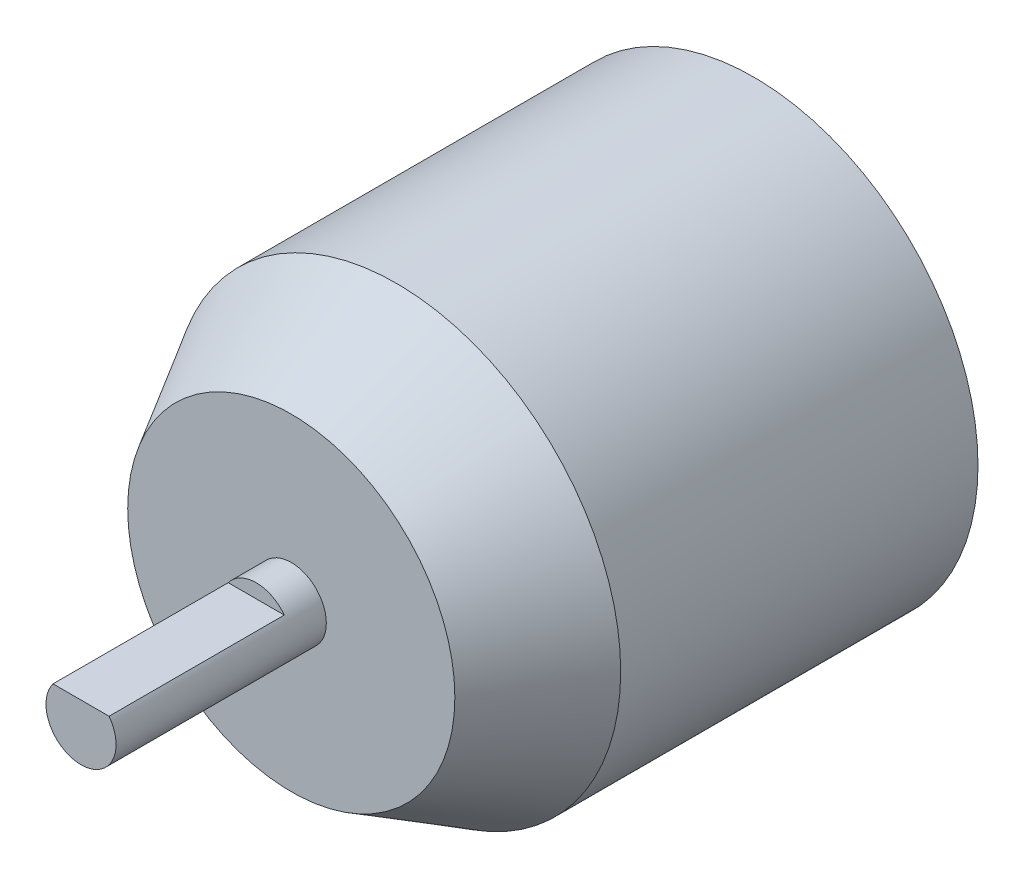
ISO-10303-21;
HEADER;
FILE_DESCRIPTION(('STEP AP214'),'2;1');
FILE_NAME('part.step','',(''),(''),'','','');
FILE_SCHEMA(('AUTOMOTIVE_DESIGN { 1 0 10303 214 1 1 1 1 }'));
ENDSEC;
DATA;
#1=APPLICATION_CONTEXT('core data for automotive mechanical design processes');
#2=APPLICATION_PROTOCOL_DEFINITION('international standard','automotive_design',2000,#1);
#3=PRODUCT_CONTEXT('',#1,'mechanical');
#4=PRODUCT('Part','Part','',(#3));
#5=PRODUCT_RELATED_PRODUCT_CATEGORY('part','',(#4));
#6=PRODUCT_DEFINITION_FORMATION('','',#4);
#7=PRODUCT_DEFINITION_CONTEXT('part definition',#1,'design');
#8=PRODUCT_DEFINITION('design','',#6,#7);
#9=PRODUCT_DEFINITION_SHAPE('','',#8);
#10=(LENGTH_UNIT() NAMED_UNIT(*) SI_UNIT(.MILLI.,.METRE.));
#11=(NAMED_UNIT(*) PLANE_ANGLE_UNIT() SI_UNIT($,.RADIAN.));
#12=(NAMED_UNIT(*) SI_UNIT($,.STERADIAN.) SOLID_ANGLE_UNIT());
#13=UNCERTAINTY_MEASURE_WITH_UNIT(LENGTH_MEASURE(1.E-05),#10,'distance_accuracy_value','');
#14=(GEOMETRIC_REPRESENTATION_CONTEXT(3) GLOBAL_UNCERTAINTY_ASSIGNED_CONTEXT((#13)) GLOBAL_UNIT_ASSIGNED_CONTEXT((#10,
#11,#12)) REPRESENTATION_CONTEXT('',''));
#15=CARTESIAN_POINT('',(0.,0.,0.));
#16=DIRECTION('',(0.,0.,1.));
#17=DIRECTION('',(1.,0.,0.));
#18=AXIS2_PLACEMENT_3D('',#15,#16,#17);
#19=CARTESIAN_POINT('',(0.,0.,70.));
#20=DIRECTION('',(0.,0.,-1.));
#21=DIRECTION('',(-1.,0.,0.));
#22=AXIS2_PLACEMENT_3D('',#19,#20,#21);
#23=CYLINDRICAL_SURFACE('',#22,32.);
#24=CARTESIAN_POINT('',(0.,0.,4.01923788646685));
#25=DIRECTION('',(0.,0.,1.));
#26=DIRECTION('',(1.,0.,0.));
#27=AXIS2_PLACEMENT_3D('',#24,#25,#26);
#28=CIRCLE('',#27,32.);
#29=CARTESIAN_POINT('',(32.,0.,4.01923788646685));
#30=VERTEX_POINT('',#29);
#31=EDGE_CURVE('E84',#30,#30,#28,.T.);
#32=ORIENTED_EDGE('',*,*,#31,.T.);
#33=EDGE_LOOP('',(#32));
#34=FACE_BOUND('',#33,.T.);
#35=CARTESIAN_POINT('',(0.,0.,54.9999999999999));
#36=DIRECTION('',(0.,0.,1.));
#37=DIRECTION('',(1.,0.,0.));
#38=AXIS2_PLACEMENT_3D('',#35,#36,#37);
#39=CIRCLE('',#38,32.);
#40=CARTESIAN_POINT('',(32.,0.,54.9999999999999));
#41=VERTEX_POINT('',#40);
#42=EDGE_CURVE('E81',#41,#41,#39,.F.);
#43=ORIENTED_EDGE('',*,*,#42,.T.);
#44=EDGE_LOOP('',(#43));
#45=FACE_BOUND('',#44,.T.);
#46=ADVANCED_FACE('F34',(#34,#45),#23,.T.);
#47=CARTESIAN_POINT('',(0.,0.,70.));
#48=DIRECTION('',(0.,0.,1.));
#49=DIRECTION('',(1.,0.,0.));
#50=AXIS2_PLACEMENT_3D('',#47,#48,#49);
#51=PLANE('',#50);
#52=CARTESIAN_POINT('',(0.,0.,70.));
#53=DIRECTION('',(0.,0.,1.));
#54=DIRECTION('',(1.,0.,0.));
#55=AXIS2_PLACEMENT_3D('',#52,#53,#54);
#56=CIRCLE('',#55,23.3397459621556);
#57=CARTESIAN_POINT('',(23.3397459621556,0.,70.));
#58=VERTEX_POINT('',#57);
#59=EDGE_CURVE('E75',#58,#58,#56,.T.);
#60=ORIENTED_EDGE('',*,*,#59,.T.);
#61=EDGE_LOOP('',(#60));
#62=FACE_BOUND('',#61,.T.);
#63=CARTESIAN_POINT('',(0.,0.,70.));
#64=DIRECTION('',(0.,0.,1.));
#65=DIRECTION('',(1.,0.,0.));
#66=AXIS2_PLACEMENT_3D('',#63,#64,#65);
#67=CIRCLE('',#66,5.);
#68=CARTESIAN_POINT('',(5.,0.,70.));
#69=VERTEX_POINT('',#68);
#70=EDGE_CURVE('E72',#69,#69,#67,.T.);
#71=ORIENTED_EDGE('',*,*,#70,.F.);
#72=EDGE_LOOP('',(#71));
#73=FACE_BOUND('',#72,.T.);
#74=ADVANCED_FACE('F100',(#62,#73),#51,.T.);
#75=CARTESIAN_POINT('',(0.,0.,0.));
#76=DIRECTION('',(0.,0.,1.));
#77=DIRECTION('',(1.,0.,0.));
#78=AXIS2_PLACEMENT_3D('',#75,#76,#77);
#79=PLANE('',#78);
#80=CARTESIAN_POINT('',(0.,0.,0.));
#81=DIRECTION('',(0.,0.,1.));
#82=DIRECTION('',(1.,0.,0.));
#83=AXIS2_PLACEMENT_3D('',#80,#81,#82);
#84=CIRCLE('',#83,16.9999999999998);
#85=CARTESIAN_POINT('',(16.9999999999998,0.,0.));
#86=VERTEX_POINT('',#85);
#87=EDGE_CURVE('E64',#86,#86,#84,.F.);
#88=ORIENTED_EDGE('',*,*,#87,.T.);
#89=EDGE_LOOP('',(#88));
#90=FACE_BOUND('',#89,.T.);
#91=ADVANCED_FACE('F90',(#90),#79,.F.);
#92=CARTESIAN_POINT('',(0.,0.,100.));
#93=DIRECTION('',(0.,0.,-1.));
#94=DIRECTION('',(-1.,0.,0.));
#95=AXIS2_PLACEMENT_3D('',#92,#93,#94);
#96=CYLINDRICAL_SURFACE('',#95,5.);
#97=CARTESIAN_POINT('',(0.,0.,100.));
#98=DIRECTION('',(0.,0.,1.));
#99=DIRECTION('',(1.,0.,0.));
#100=AXIS2_PLACEMENT_3D('',#97,#98,#99);
#101=CIRCLE('',#100,5.);
#102=CARTESIAN_POINT('',(-4.,3.,100.));
#103=VERTEX_POINT('',#102);
#104=CARTESIAN_POINT('',(4.,3.,100.));
#105=VERTEX_POINT('',#104);
#106=EDGE_CURVE('E68',#103,#105,#101,.T.);
#107=ORIENTED_EDGE('',*,*,#106,.F.);
#108=DIRECTION('',(0.,0.,-1.));
#109=VECTOR('',#108,1.);
#110=CARTESIAN_POINT('',(-4.,3.,100.));
#111=LINE('',#110,#109);
#112=CARTESIAN_POINT('',(-4.,3.,75.));
#113=VERTEX_POINT('',#112);
#114=EDGE_CURVE('E49',#103,#113,#111,.T.);
#115=ORIENTED_EDGE('',*,*,#114,.T.);
#116=CARTESIAN_POINT('',(0.,0.,75.));
#117=DIRECTION('',(0.,0.,-1.));
#118=DIRECTION('',(-1.,0.,0.));
#119=AXIS2_PLACEMENT_3D('',#116,#117,#118);
#120=CIRCLE('',#119,5.);
#121=CARTESIAN_POINT('',(4.,3.,75.));
#122=VERTEX_POINT('',#121);
#123=EDGE_CURVE('E11',#113,#122,#120,.T.);
#124=ORIENTED_EDGE('',*,*,#123,.T.);
#125=DIRECTION('',(0.,0.,-1.));
#126=VECTOR('',#125,1.);
#127=CARTESIAN_POINT('',(4.,3.,100.));
#128=LINE('',#127,#126);
#129=EDGE_CURVE('E54',#122,#105,#128,.F.);
#130=ORIENTED_EDGE('',*,*,#129,.T.);
#131=EDGE_LOOP('',(#107,#115,#124,#130));
#132=FACE_BOUND('',#131,.T.);
#133=ORIENTED_EDGE('',*,*,#70,.T.);
#134=EDGE_LOOP('',(#133));
#135=FACE_BOUND('',#134,.T.);
#136=ADVANCED_FACE('F66',(#132,#135),#96,.T.);
#137=CARTESIAN_POINT('',(0.,0.,100.));
#138=DIRECTION('',(0.,0.,1.));
#139=DIRECTION('',(1.,0.,0.));
#140=AXIS2_PLACEMENT_3D('',#137,#138,#139);
#141=PLANE('',#140);
#142=DIRECTION('',(1.,0.,0.));
#143=VECTOR('',#142,1.);
#144=CARTESIAN_POINT('',(0.,3.,100.));
#145=LINE('',#144,#143);
#146=EDGE_CURVE('E42',#103,#105,#145,.T.);
#147=ORIENTED_EDGE('',*,*,#146,.F.);
#148=ORIENTED_EDGE('',*,*,#106,.T.);
#149=EDGE_LOOP('',(#147,#148));
#150=FACE_BOUND('',#149,.T.);
#151=ADVANCED_FACE('F71',(#150),#141,.T.);
#152=CARTESIAN_POINT('',(0.,0.,70.));
#153=DIRECTION('',(0.,0.,-1.));
#154=DIRECTION('',(-1.,0.,0.));
#155=AXIS2_PLACEMENT_3D('',#152,#153,#154);
#156=CONICAL_SURFACE('',#155,23.3397459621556,0.523598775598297);
#157=ORIENTED_EDGE('',*,*,#42,.F.);
#158=EDGE_LOOP('',(#157));
#159=FACE_BOUND('',#158,.T.);
#160=ORIENTED_EDGE('',*,*,#59,.F.);
#161=EDGE_LOOP('',(#160));
#162=FACE_BOUND('',#161,.T.);
#163=ADVANCED_FACE('F95',(#159,#162),#156,.T.);
#164=CARTESIAN_POINT('',(0.,0.,4.01923788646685));
#165=DIRECTION('',(0.,0.,1.));
#166=DIRECTION('',(1.,0.,0.));
#167=AXIS2_PLACEMENT_3D('',#164,#165,#166);
#168=CONICAL_SURFACE('',#167,32.,1.30899693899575);
#169=ORIENTED_EDGE('',*,*,#87,.F.);
#170=EDGE_LOOP('',(#169));
#171=FACE_BOUND('',#170,.T.);
#172=ORIENTED_EDGE('',*,*,#31,.F.);
#173=EDGE_LOOP('',(#172));
#174=FACE_BOUND('',#173,.T.);
#175=ADVANCED_FACE('F36',(#171,#174),#168,.T.);
#176=CARTESIAN_POINT('',(0.,0.,75.));
#177=DIRECTION('',(0.,0.,-1.));
#178=DIRECTION('',(-1.,0.,0.));
#179=AXIS2_PLACEMENT_3D('',#176,#177,#178);
#180=PLANE('',#179);
#181=DIRECTION('',(1.,0.,0.));
#182=VECTOR('',#181,1.);
#183=CARTESIAN_POINT('',(-33.0198725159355,3.,75.));
#184=LINE('',#183,#182);
#185=EDGE_CURVE('E69',#113,#122,#184,.T.);
#186=ORIENTED_EDGE('',*,*,#185,.T.);
#187=ORIENTED_EDGE('',*,*,#123,.F.);
#188=EDGE_LOOP('',(#186,#187));
#189=FACE_BOUND('',#188,.T.);
#190=ADVANCED_FACE('F94',(#189),#180,.F.);
#191=CARTESIAN_POINT('',(-33.0198725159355,3.,75.));
#192=DIRECTION('',(0.,-1.,0.));
#193=DIRECTION('',(0.,0.,-1.));
#194=AXIS2_PLACEMENT_3D('',#191,#192,#193);
#195=PLANE('',#194);
#196=ORIENTED_EDGE('',*,*,#146,.T.);
#197=ORIENTED_EDGE('',*,*,#129,.F.);
#198=ORIENTED_EDGE('',*,*,#185,.F.);
#199=ORIENTED_EDGE('',*,*,#114,.F.);
#200=EDGE_LOOP('',(#196,#197,#198,#199));
#201=FACE_BOUND('',#200,.T.);
#202=ADVANCED_FACE('F60',(#201),#195,.F.);
#203=CLOSED_SHELL('',(#46,#74,#91,#136,#151,#163,#175,#190,#202));
#204=MANIFOLD_SOLID_BREP('B2',#203);
#205=ADVANCED_BREP_SHAPE_REPRESENTATION('',(#18,#204),#14);
#206=SHAPE_DEFINITION_REPRESENTATION(#9,#205);
ENDSEC;
END-ISO-10303-21;
